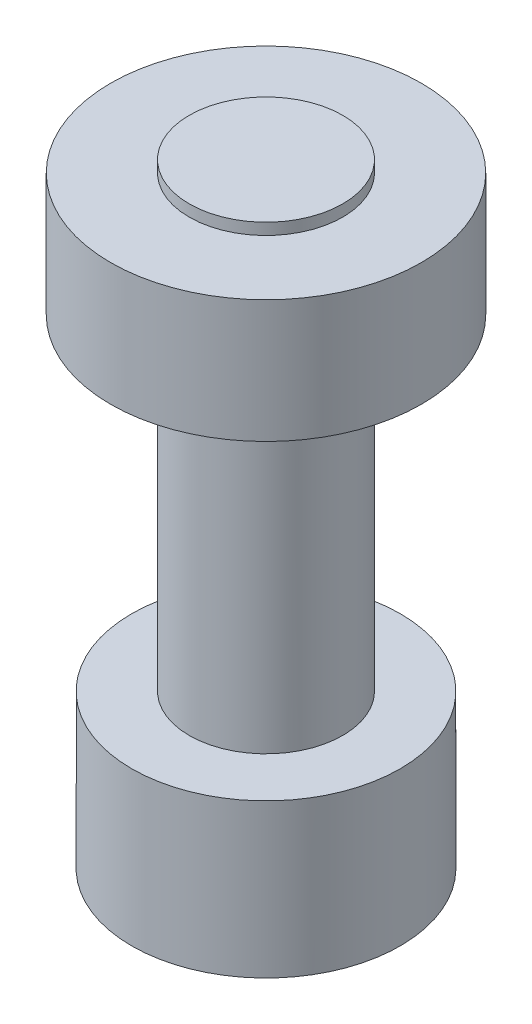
ISO-10303-21;
HEADER;
FILE_DESCRIPTION(('STEP AP214'),'2;1');
FILE_NAME('part.step','',(''),(''),'','','');
FILE_SCHEMA(('AUTOMOTIVE_DESIGN { 1 0 10303 214 1 1 1 1 }'));
ENDSEC;
DATA;
#1=APPLICATION_CONTEXT('core data for automotive mechanical design processes');
#2=APPLICATION_PROTOCOL_DEFINITION('international standard','automotive_design',2000,#1);
#3=PRODUCT_CONTEXT('',#1,'mechanical');
#4=PRODUCT('Part','Part','',(#3));
#5=PRODUCT_RELATED_PRODUCT_CATEGORY('part','',(#4));
#6=PRODUCT_DEFINITION_FORMATION('','',#4);
#7=PRODUCT_DEFINITION_CONTEXT('part definition',#1,'design');
#8=PRODUCT_DEFINITION('design','',#6,#7);
#9=PRODUCT_DEFINITION_SHAPE('','',#8);
#10=(LENGTH_UNIT() NAMED_UNIT(*) SI_UNIT(.MILLI.,.METRE.));
#11=(NAMED_UNIT(*) PLANE_ANGLE_UNIT() SI_UNIT($,.RADIAN.));
#12=(NAMED_UNIT(*) SI_UNIT($,.STERADIAN.) SOLID_ANGLE_UNIT());
#13=UNCERTAINTY_MEASURE_WITH_UNIT(LENGTH_MEASURE(1.E-05),#10,'distance_accuracy_value','');
#14=(GEOMETRIC_REPRESENTATION_CONTEXT(3) GLOBAL_UNCERTAINTY_ASSIGNED_CONTEXT((#13)) GLOBAL_UNIT_ASSIGNED_CONTEXT((#10,
#11,#12)) REPRESENTATION_CONTEXT('',''));
#15=CARTESIAN_POINT('',(0.,0.,0.));
#16=DIRECTION('',(0.,0.,1.));
#17=DIRECTION('',(1.,0.,0.));
#18=AXIS2_PLACEMENT_3D('',#15,#16,#17);
#19=CARTESIAN_POINT('',(22.,26.92,-41.));
#20=DIRECTION('',(0.,1.,0.));
#21=DIRECTION('',(0.,0.,1.));
#22=AXIS2_PLACEMENT_3D('',#19,#20,#21);
#23=CYLINDRICAL_SURFACE('',#22,2.);
#24=CARTESIAN_POINT('',(22.,35.5,-41.));
#25=DIRECTION('',(0.,-1.,0.));
#26=DIRECTION('',(0.,0.,-1.));
#27=AXIS2_PLACEMENT_3D('',#24,#25,#26);
#28=CIRCLE('',#27,2.);
#29=CARTESIAN_POINT('',(22.,35.5,-43.));
#30=VERTEX_POINT('',#29);
#31=EDGE_CURVE('E20',#30,#30,#28,.F.);
#32=ORIENTED_EDGE('',*,*,#31,.F.);
#33=EDGE_LOOP('',(#32));
#34=FACE_BOUND('',#33,.T.);
#35=CARTESIAN_POINT('',(22.,27.,-41.));
#36=DIRECTION('',(0.,1.,0.));
#37=DIRECTION('',(0.,0.,1.));
#38=AXIS2_PLACEMENT_3D('',#35,#36,#37);
#39=CIRCLE('',#38,2.);
#40=CARTESIAN_POINT('',(22.,27.,-39.));
#41=VERTEX_POINT('',#40);
#42=EDGE_CURVE('E24',#41,#41,#39,.F.);
#43=ORIENTED_EDGE('',*,*,#42,.F.);
#44=EDGE_LOOP('',(#43));
#45=FACE_BOUND('',#44,.T.);
#46=ADVANCED_FACE('F14',(#34,#45),#23,.T.);
#47=CARTESIAN_POINT('',(22.,27.,-41.));
#48=DIRECTION('',(0.,1.,0.));
#49=DIRECTION('',(0.,0.,1.));
#50=AXIS2_PLACEMENT_3D('',#47,#48,#49);
#51=PLANE('',#50);
#52=ORIENTED_EDGE('',*,*,#42,.T.);
#53=EDGE_LOOP('',(#52));
#54=FACE_BOUND('',#53,.T.);
#55=CARTESIAN_POINT('',(22.,27.,-41.));
#56=DIRECTION('',(0.,-1.,0.));
#57=DIRECTION('',(0.,0.,-1.));
#58=AXIS2_PLACEMENT_3D('',#55,#56,#57);
#59=CIRCLE('',#58,3.5);
#60=CARTESIAN_POINT('',(22.,27.,-44.5));
#61=VERTEX_POINT('',#60);
#62=EDGE_CURVE('E31',#61,#61,#59,.T.);
#63=ORIENTED_EDGE('',*,*,#62,.F.);
#64=EDGE_LOOP('',(#63));
#65=FACE_BOUND('',#64,.T.);
#66=ADVANCED_FACE('F64',(#54,#65),#51,.T.);
#67=CARTESIAN_POINT('',(22.,23.,-41.));
#68=DIRECTION('',(0.,-1.,0.));
#69=DIRECTION('',(0.,0.,-1.));
#70=AXIS2_PLACEMENT_3D('',#67,#68,#69);
#71=PLANE('',#70);
#72=CARTESIAN_POINT('',(22.,23.,-41.));
#73=DIRECTION('',(0.,1.,0.));
#74=DIRECTION('',(0.,0.,1.));
#75=AXIS2_PLACEMENT_3D('',#72,#73,#74);
#76=CIRCLE('',#75,3.5);
#77=CARTESIAN_POINT('',(22.,23.,-37.5));
#78=VERTEX_POINT('',#77);
#79=EDGE_CURVE('E38',#78,#78,#76,.T.);
#80=ORIENTED_EDGE('',*,*,#79,.F.);
#81=EDGE_LOOP('',(#80));
#82=FACE_BOUND('',#81,.T.);
#83=ADVANCED_FACE('F66',(#82),#71,.T.);
#84=CARTESIAN_POINT('',(22.,23.,-41.));
#85=DIRECTION('',(0.,1.,0.));
#86=DIRECTION('',(0.,0.,1.));
#87=AXIS2_PLACEMENT_3D('',#84,#85,#86);
#88=CYLINDRICAL_SURFACE('',#87,3.5);
#89=ORIENTED_EDGE('',*,*,#62,.T.);
#90=EDGE_LOOP('',(#89));
#91=FACE_BOUND('',#90,.T.);
#92=ORIENTED_EDGE('',*,*,#79,.T.);
#93=EDGE_LOOP('',(#92));
#94=FACE_BOUND('',#93,.T.);
#95=ADVANCED_FACE('F58',(#91,#94),#88,.T.);
#96=CARTESIAN_POINT('',(22.,38.7,-41.));
#97=DIRECTION('',(0.,1.,0.));
#98=DIRECTION('',(0.,0.,1.));
#99=AXIS2_PLACEMENT_3D('',#96,#97,#98);
#100=PLANE('',#99);
#101=CARTESIAN_POINT('',(22.,38.7,-41.));
#102=DIRECTION('',(0.,1.,0.));
#103=DIRECTION('',(0.,0.,1.));
#104=AXIS2_PLACEMENT_3D('',#101,#102,#103);
#105=CIRCLE('',#104,2.);
#106=CARTESIAN_POINT('',(22.,38.7,-39.));
#107=VERTEX_POINT('',#106);
#108=EDGE_CURVE('E9',#107,#107,#105,.F.);
#109=ORIENTED_EDGE('',*,*,#108,.T.);
#110=EDGE_LOOP('',(#109));
#111=FACE_BOUND('',#110,.T.);
#112=CARTESIAN_POINT('',(22.,38.7,-41.));
#113=DIRECTION('',(0.,-1.,0.));
#114=DIRECTION('',(0.,0.,-1.));
#115=AXIS2_PLACEMENT_3D('',#112,#113,#114);
#116=CIRCLE('',#115,4.05);
#117=CARTESIAN_POINT('',(22.,38.7,-45.05));
#118=VERTEX_POINT('',#117);
#119=EDGE_CURVE('E39',#118,#118,#116,.T.);
#120=ORIENTED_EDGE('',*,*,#119,.F.);
#121=EDGE_LOOP('',(#120));
#122=FACE_BOUND('',#121,.T.);
#123=ADVANCED_FACE('F49',(#111,#122),#100,.T.);
#124=CARTESIAN_POINT('',(22.,35.5,-41.));
#125=DIRECTION('',(0.,-1.,0.));
#126=DIRECTION('',(0.,0.,-1.));
#127=AXIS2_PLACEMENT_3D('',#124,#125,#126);
#128=PLANE('',#127);
#129=ORIENTED_EDGE('',*,*,#31,.T.);
#130=EDGE_LOOP('',(#129));
#131=FACE_BOUND('',#130,.T.);
#132=CARTESIAN_POINT('',(22.,35.5,-41.));
#133=DIRECTION('',(0.,1.,0.));
#134=DIRECTION('',(0.,0.,1.));
#135=AXIS2_PLACEMENT_3D('',#132,#133,#134);
#136=CIRCLE('',#135,4.05);
#137=CARTESIAN_POINT('',(22.,35.5,-36.95));
#138=VERTEX_POINT('',#137);
#139=EDGE_CURVE('E45',#138,#138,#136,.T.);
#140=ORIENTED_EDGE('',*,*,#139,.F.);
#141=EDGE_LOOP('',(#140));
#142=FACE_BOUND('',#141,.T.);
#143=ADVANCED_FACE('F48',(#131,#142),#128,.T.);
#144=CARTESIAN_POINT('',(22.,35.5,-41.));
#145=DIRECTION('',(0.,1.,0.));
#146=DIRECTION('',(0.,0.,1.));
#147=AXIS2_PLACEMENT_3D('',#144,#145,#146);
#148=CYLINDRICAL_SURFACE('',#147,4.05);
#149=ORIENTED_EDGE('',*,*,#119,.T.);
#150=EDGE_LOOP('',(#149));
#151=FACE_BOUND('',#150,.T.);
#152=ORIENTED_EDGE('',*,*,#139,.T.);
#153=EDGE_LOOP('',(#152));
#154=FACE_BOUND('',#153,.T.);
#155=ADVANCED_FACE('F46',(#151,#154),#148,.T.);
#156=CARTESIAN_POINT('',(22.,39.,-41.));
#157=DIRECTION('',(0.,1.,0.));
#158=DIRECTION('',(0.,0.,1.));
#159=AXIS2_PLACEMENT_3D('',#156,#157,#158);
#160=PLANE('',#159);
#161=CARTESIAN_POINT('',(22.,39.,-41.));
#162=DIRECTION('',(0.,-1.,0.));
#163=DIRECTION('',(0.,0.,-1.));
#164=AXIS2_PLACEMENT_3D('',#161,#162,#163);
#165=CIRCLE('',#164,2.);
#166=CARTESIAN_POINT('',(22.,39.,-43.));
#167=VERTEX_POINT('',#166);
#168=EDGE_CURVE('E29',#167,#167,#165,.T.);
#169=ORIENTED_EDGE('',*,*,#168,.F.);
#170=EDGE_LOOP('',(#169));
#171=FACE_BOUND('',#170,.T.);
#172=ADVANCED_FACE('F60',(#171),#160,.T.);
#173=ORIENTED_EDGE('',*,*,#108,.F.);
#174=EDGE_LOOP('',(#173));
#175=FACE_BOUND('',#174,.T.);
#176=ORIENTED_EDGE('',*,*,#168,.T.);
#177=EDGE_LOOP('',(#176));
#178=FACE_BOUND('',#177,.T.);
#179=ADVANCED_FACE('F65',(#175,#178),#23,.T.);
#180=CLOSED_SHELL('',(#46,#66,#83,#95,#123,#143,#155,#172,#179));
#181=MANIFOLD_SOLID_BREP('B1',#180);
#182=ADVANCED_BREP_SHAPE_REPRESENTATION('',(#18,#181),#14);
#183=SHAPE_DEFINITION_REPRESENTATION(#9,#182);
ENDSEC;
END-ISO-10303-21;
